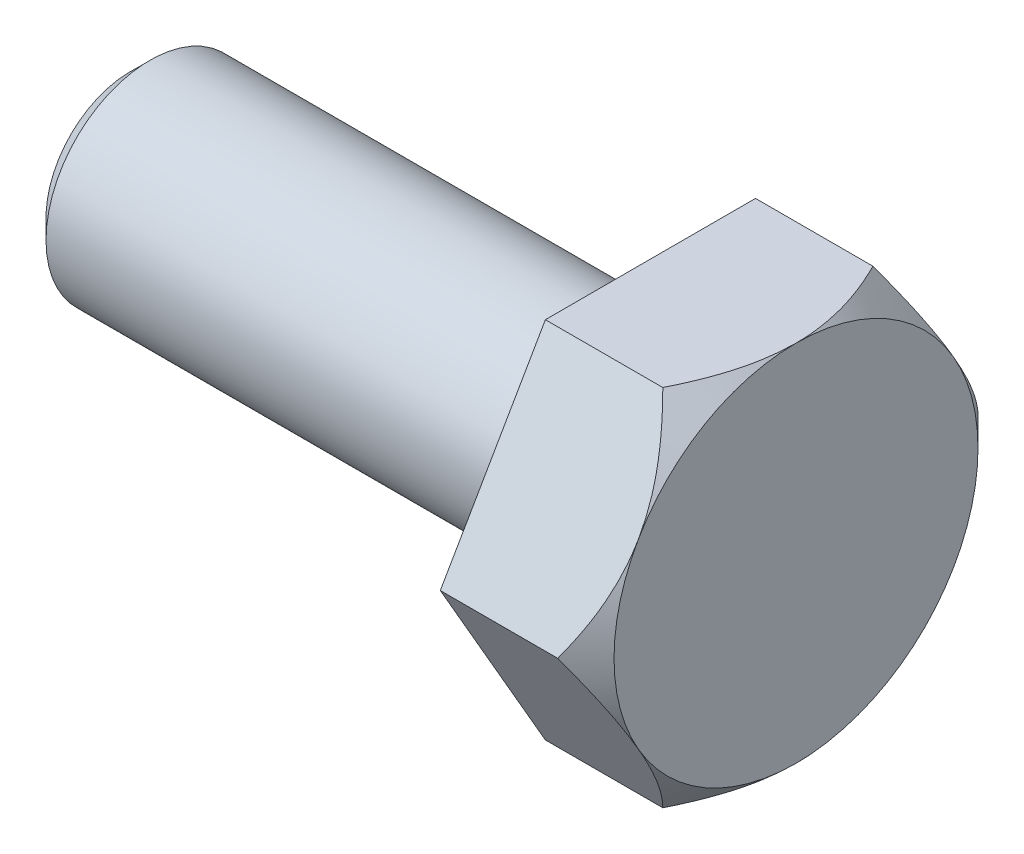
from build123d import *

# Parameters (mm, degrees)
CHANFREIN_TIGE_SIZE     = 0.375
ENL_V_MAT_EXTRU_1_REACH = 16.797
ESQUISSE2_R             = 5.25
ESQUISSE3_OUTSIDE_W     = 19.418
ESQUISSE3_OUTSIDE_H     = 18.336
ESQUISSE3_OUTSIDE_R     = 3.5
ENL_V_MAT_EXTRU_2_DEPTH = 3
ENL_V_MAT_EXTRU_2_DRAFT = -45


with BuildPart() as part:
    # Esquisse1 → Base-R_volution (revolve)
    with BuildSketch(Plane.XY, mode=Mode.PRIVATE) as base_r_volution_sk:
        Polygon((0, -2), (0, -5.25), (2.8, -5.25), (2.8, 0), (-10, 0), (-10, -2), align=None)
    revolve(base_r_volution_sk.sketch.rotate(Axis((12.49963034, 0, 0), (-1, 0, 0)), 270), axis=Axis((12.49963034, 0, 0), (-1, 0, 0)))

    # Chanfrein tige
    chanfrein_tige_edges = [part.edges().sort_by_distance(p)[0] for p in [
        (-10, 0, 2),
    ]]
    chamfer(chanfrein_tige_edges, length=CHANFREIN_TIGE_SIZE)

    # Esquisse2 → Enl_v. mat.-Extru.1 (cut, up to next)
    with BuildSketch(Plane(origin=(2.8, 0, 0), x_dir=(0, 0, -1), z_dir=(1, 0, 0)), mode=Mode.PRIVATE) as enl_v_mat_extru_1_sk1:
        Circle(ESQUISSE2_R)
        Polygon((4.041451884, 0), (2.020725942, 3.5), (-2.020725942, 3.5), (-4.041451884, 0), (-2.020725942, -3.5), (2.020725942, -3.5), align=None, mode=Mode.SUBTRACT)
    enl_v_mat_extru_1_tool1 = extrude(enl_v_mat_extru_1_sk1.sketch, amount=-ENL_V_MAT_EXTRU_1_REACH, mode=Mode.PRIVATE) & part.part
    add(enl_v_mat_extru_1_tool1.solids().sort_by_distance((2.8, 0, 5.101508))[0], mode=Mode.SUBTRACT)


with BuildPart() as enl_v_mat_extru_2_tool:
    # Esquisse3 outside → Enl_v. mat.-Extru.2 (with draft: the straight prism first)
    with BuildSketch(Plane(origin=(2.8, 0, 0), x_dir=(0, 0, -1), z_dir=(1, 0, 0))):
        Rectangle(ESQUISSE3_OUTSIDE_W, ESQUISSE3_OUTSIDE_H)
        Circle(ESQUISSE3_OUTSIDE_R, mode=Mode.SUBTRACT)
    extrude(amount=-ENL_V_MAT_EXTRU_2_DEPTH)
    # Enl_v. mat.-Extru.2: the draft: its side faces are tilted about the plane it starts from
    enl_v_mat_extru_2_sides = [enl_v_mat_extru_2_tool.faces().sort_by_distance(p)[0] for p in [
        (1.3, -9.168, 0),
        (1.3, 0, -9.709),
        (1.3, 9.168, 0),
        (1.3, 0, 9.709),
        (1.3, 0, 3.5),
    ]]
    draft(enl_v_mat_extru_2_sides, Plane(origin=(2.8, 0, 0), x_dir=(0, 0, -1), z_dir=(1, 0, 0)), ENL_V_MAT_EXTRU_2_DRAFT)


with BuildPart() as part_1:
    add(part.part)

    # Enl_v. mat.-Extru.2: cut by enl_v_mat_extru_2_tool
    add(enl_v_mat_extru_2_tool.part, mode=Mode.SUBTRACT)


solid = part_1.part
